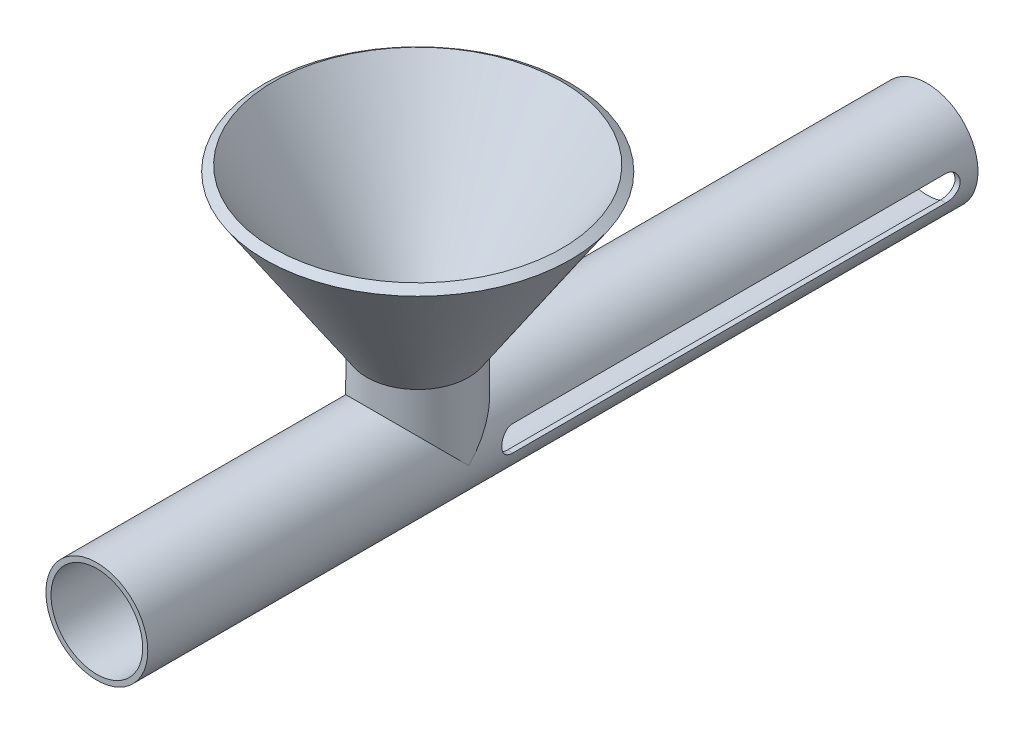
ISO-10303-21;
HEADER;
FILE_DESCRIPTION(('STEP AP214'),'2;1');
FILE_NAME('part.step','',(''),(''),'','','');
FILE_SCHEMA(('AUTOMOTIVE_DESIGN { 1 0 10303 214 1 1 1 1 }'));
ENDSEC;
DATA;
#1=APPLICATION_CONTEXT('core data for automotive mechanical design processes');
#2=APPLICATION_PROTOCOL_DEFINITION('international standard','automotive_design',2000,#1);
#3=PRODUCT_CONTEXT('',#1,'mechanical');
#4=PRODUCT('Part','Part','',(#3));
#5=PRODUCT_RELATED_PRODUCT_CATEGORY('part','',(#4));
#6=PRODUCT_DEFINITION_FORMATION('','',#4);
#7=PRODUCT_DEFINITION_CONTEXT('part definition',#1,'design');
#8=PRODUCT_DEFINITION('design','',#6,#7);
#9=PRODUCT_DEFINITION_SHAPE('','',#8);
#10=(LENGTH_UNIT() NAMED_UNIT(*) SI_UNIT(.MILLI.,.METRE.));
#11=(NAMED_UNIT(*) PLANE_ANGLE_UNIT() SI_UNIT($,.RADIAN.));
#12=(NAMED_UNIT(*) SI_UNIT($,.STERADIAN.) SOLID_ANGLE_UNIT());
#13=UNCERTAINTY_MEASURE_WITH_UNIT(LENGTH_MEASURE(1.E-05),#10,'distance_accuracy_value','');
#14=(GEOMETRIC_REPRESENTATION_CONTEXT(3) GLOBAL_UNCERTAINTY_ASSIGNED_CONTEXT((#13)) GLOBAL_UNIT_ASSIGNED_CONTEXT((#10,
#11,#12)) REPRESENTATION_CONTEXT('',''));
#15=CARTESIAN_POINT('',(0.,0.,0.));
#16=DIRECTION('',(0.,0.,1.));
#17=DIRECTION('',(1.,0.,0.));
#18=AXIS2_PLACEMENT_3D('',#15,#16,#17);
#19=CARTESIAN_POINT('',(0.,16.1094003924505,-63.));
#20=DIRECTION('',(0.,1.,0.));
#21=DIRECTION('',(0.,0.,1.));
#22=AXIS2_PLACEMENT_3D('',#19,#20,#21);
#23=CONICAL_SURFACE('',#22,8.33589941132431,0.588002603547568);
#24=CARTESIAN_POINT('',(0.,46.1094003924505,-63.));
#25=DIRECTION('',(0.,1.,0.));
#26=DIRECTION('',(0.,0.,-1.));
#27=AXIS2_PLACEMENT_3D('',#24,#25,#26);
#28=CIRCLE('',#27,28.3358994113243);
#29=CARTESIAN_POINT('',(0.,46.1094003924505,-91.3358994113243));
#30=VERTEX_POINT('',#29);
#31=EDGE_CURVE('E330',#30,#30,#28,.T.);
#32=ORIENTED_EDGE('',*,*,#31,.T.);
#33=EDGE_LOOP('',(#32));
#34=FACE_BOUND('',#33,.T.);
#35=CARTESIAN_POINT('',(0.,17.105551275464,-63.));
#36=DIRECTION('',(0.,1.,0.));
#37=DIRECTION('',(0.,0.,1.));
#38=AXIS2_PLACEMENT_3D('',#35,#36,#37);
#39=CIRCLE('',#38,8.99999999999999);
#40=CARTESIAN_POINT('',(0.,17.105551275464,-54.));
#41=VERTEX_POINT('',#40);
#42=EDGE_CURVE('E338',#41,#41,#39,.T.);
#43=ORIENTED_EDGE('',*,*,#42,.F.);
#44=EDGE_LOOP('',(#43));
#45=FACE_BOUND('',#44,.T.);
#46=ADVANCED_FACE('F44',(#34,#45),#23,.F.);
#47=CARTESIAN_POINT('',(0.,0.,-163.));
#48=DIRECTION('',(0.,0.,1.));
#49=DIRECTION('',(1.,0.,0.));
#50=AXIS2_PLACEMENT_3D('',#47,#48,#49);
#51=CYLINDRICAL_SURFACE('',#50,10.);
#52=CARTESIAN_POINT('',(9.68245836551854,2.5,-71.9954789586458));
#53=CARTESIAN_POINT('',(9.68245064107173,2.5000080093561,-71.9263411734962));
#54=CARTESIAN_POINT('',(9.68319871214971,2.49713210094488,-71.8572081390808));
#55=CARTESIAN_POINT('',(9.68614915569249,2.4856746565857,-71.7194590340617));
#56=CARTESIAN_POINT('',(9.68835128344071,2.477094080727,-71.6508428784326));
#57=CARTESIAN_POINT('',(9.69414685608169,2.4543119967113,-71.5147459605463));
#58=CARTESIAN_POINT('',(9.69773754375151,2.4401216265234,-71.4472632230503));
#59=CARTESIAN_POINT('',(9.70619672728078,2.40625174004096,-71.3137901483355));
#60=CARTESIAN_POINT('',(9.71106524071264,2.3865721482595,-71.2477998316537));
#61=CARTESIAN_POINT('',(9.7273836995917,2.31951549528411,-71.0527688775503));
#62=CARTESIAN_POINT('',(9.74055281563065,2.26409745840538,-70.9265315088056));
#63=CARTESIAN_POINT('',(9.76997886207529,2.13353299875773,-70.6851730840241));
#64=CARTESIAN_POINT('',(9.78623662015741,2.05838128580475,-70.5700550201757));
#65=CARTESIAN_POINT('',(9.82040642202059,1.88871268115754,-70.3516267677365));
#66=CARTESIAN_POINT('',(9.83834473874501,1.79384357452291,-70.2485937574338));
#67=CARTESIAN_POINT('',(9.87362764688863,1.5881890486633,-70.0597217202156));
#68=CARTESIAN_POINT('',(9.89097214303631,1.47740109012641,-69.9738854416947));
#69=CARTESIAN_POINT('',(9.92340454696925,1.24114235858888,-69.8207020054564));
#70=CARTESIAN_POINT('',(9.93845761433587,1.11548838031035,-69.7536293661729));
#71=CARTESIAN_POINT('',(9.96430865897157,0.854256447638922,-69.6416669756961));
#72=CARTESIAN_POINT('',(9.97510747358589,0.718680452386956,-69.5967728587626));
#73=CARTESIAN_POINT('',(9.99104749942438,0.444360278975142,-69.5313315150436));
#74=CARTESIAN_POINT('',(9.99629882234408,0.305735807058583,-69.5103097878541));
#75=CARTESIAN_POINT('',(10.0009359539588,0.026831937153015,-69.4917205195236));
#76=CARTESIAN_POINT('',(10.0003224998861,-0.113447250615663,-69.4941500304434));
#77=CARTESIAN_POINT('',(9.99338093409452,-0.388381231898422,-69.5220538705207));
#78=CARTESIAN_POINT('',(9.98717996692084,-0.523091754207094,-69.5470155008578));
#79=CARTESIAN_POINT('',(9.96990826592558,-0.786346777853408,-69.6184506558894));
#80=CARTESIAN_POINT('',(9.95883731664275,-0.914891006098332,-69.6649251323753));
#81=CARTESIAN_POINT('',(9.93287494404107,-1.16351821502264,-69.7784821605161));
#82=CARTESIAN_POINT('',(9.91794984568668,-1.28351407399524,-69.8457474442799));
#83=CARTESIAN_POINT('',(9.88589863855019,-1.51069157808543,-69.9988367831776));
#84=CARTESIAN_POINT('',(9.86877219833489,-1.61787128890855,-70.0846636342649));
#85=CARTESIAN_POINT('',(9.83363915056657,-1.81942347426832,-70.2751762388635));
#86=CARTESIAN_POINT('',(9.81562126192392,-1.9133727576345,-70.3803080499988));
#87=CARTESIAN_POINT('',(9.78115420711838,-2.08242393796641,-70.6050536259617));
#88=CARTESIAN_POINT('',(9.76470547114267,-2.15752067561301,-70.7246713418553));
#89=CARTESIAN_POINT('',(9.73519533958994,-2.28701177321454,-70.9758429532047));
#90=CARTESIAN_POINT('',(9.72215264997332,-2.34129254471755,-71.1074576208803));
#91=CARTESIAN_POINT('',(9.70117647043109,-2.42675587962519,-71.3782712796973));
#92=CARTESIAN_POINT('',(9.693235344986,-2.45797297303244,-71.5174585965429));
#93=CARTESIAN_POINT('',(9.6863822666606,-2.48476158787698,-71.7141224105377));
#94=CARTESIAN_POINT('',(9.68491307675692,-2.49047697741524,-71.7702782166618));
#95=CARTESIAN_POINT('',(9.6829515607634,-2.49809189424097,-71.8827734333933));
#96=CARTESIAN_POINT('',(9.68245765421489,-2.49999759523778,-71.9391123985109));
#97=CARTESIAN_POINT('',(9.68245836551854,-2.5,-71.9954789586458));
#98=B_SPLINE_CURVE_WITH_KNOTS('',3,(#52,#53,#54,#55,#56,#57,#58,#59,#60,#61,#62,#63,#64,#65,#66,
#67,#68,#69,#70,#71,#72,#73,#74,#75,#76,#77,#78,#79,#80,#81,#82,#83,#84,#85,#86,#87,#88,#89,#90,
#91,#92,#93,#94,#95,#96,#97),.UNSPECIFIED.,.F.,.F.,(4,2,2,2,2,2,2,2,2,2,2,2,2,2,2,2,2,2,2,2,2,2,
4),(0.,0.20734132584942,0.414647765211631,0.621544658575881,0.828444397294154,1.2418326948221,
1.65533192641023,2.07697423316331,2.49868387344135,2.92627416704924,3.35378025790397,
3.77263152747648,4.19143014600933,4.60093312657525,5.01045422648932,5.42368222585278,
5.83697251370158,6.26140522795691,6.68595396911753,7.11278749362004,7.53898067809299,
7.70826570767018,7.87727618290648),.UNSPECIFIED.);
#99=CARTESIAN_POINT('',(9.68245836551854,2.5,-71.9954789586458));
#100=VERTEX_POINT('',#99);
#101=CARTESIAN_POINT('',(9.68245836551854,-2.5,-71.9954789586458));
#102=VERTEX_POINT('',#101);
#103=EDGE_CURVE('E240',#100,#102,#98,.T.);
#104=ORIENTED_EDGE('',*,*,#103,.F.);
#105=DIRECTION('',(0.,0.,1.));
#106=VECTOR('',#105,1.);
#107=CARTESIAN_POINT('',(9.68245836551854,2.5,-163.));
#108=LINE('',#107,#106);
#109=CARTESIAN_POINT('',(9.68245836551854,2.5,-156.995478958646));
#110=VERTEX_POINT('',#109);
#111=EDGE_CURVE('E248',#110,#100,#108,.T.);
#112=ORIENTED_EDGE('',*,*,#111,.F.);
#113=CARTESIAN_POINT('',(9.68245836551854,-2.5,-156.995478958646));
#114=CARTESIAN_POINT('',(9.68245064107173,-2.5000080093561,-157.064616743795));
#115=CARTESIAN_POINT('',(9.68319871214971,-2.49713210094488,-157.133749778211));
#116=CARTESIAN_POINT('',(9.68614915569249,-2.4856746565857,-157.27149888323));
#117=CARTESIAN_POINT('',(9.68835128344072,-2.477094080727,-157.340115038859));
#118=CARTESIAN_POINT('',(9.6941468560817,-2.4543119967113,-157.476211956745));
#119=CARTESIAN_POINT('',(9.69773754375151,-2.44012162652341,-157.543694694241));
#120=CARTESIAN_POINT('',(9.70619672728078,-2.40625174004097,-157.677167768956));
#121=CARTESIAN_POINT('',(9.71106524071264,-2.3865721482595,-157.743158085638));
#122=CARTESIAN_POINT('',(9.7273836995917,-2.31951549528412,-157.938189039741));
#123=CARTESIAN_POINT('',(9.74055281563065,-2.26409745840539,-158.064426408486));
#124=CARTESIAN_POINT('',(9.76997886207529,-2.13353299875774,-158.305784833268));
#125=CARTESIAN_POINT('',(9.7862366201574,-2.05838128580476,-158.420902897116));
#126=CARTESIAN_POINT('',(9.82040642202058,-1.88871268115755,-158.639331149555));
#127=CARTESIAN_POINT('',(9.83834473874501,-1.79384357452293,-158.742364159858));
#128=CARTESIAN_POINT('',(9.87362764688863,-1.58818904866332,-158.931236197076));
#129=CARTESIAN_POINT('',(9.89097214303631,-1.47740109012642,-159.017072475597));
#130=CARTESIAN_POINT('',(9.92340454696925,-1.24114235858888,-159.170255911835));
#131=CARTESIAN_POINT('',(9.93845761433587,-1.11548838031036,-159.237328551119));
#132=CARTESIAN_POINT('',(9.96430865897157,-0.854256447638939,-159.349290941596));
#133=CARTESIAN_POINT('',(9.97510747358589,-0.71868045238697,-159.394185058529));
#134=CARTESIAN_POINT('',(9.99104749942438,-0.444360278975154,-159.459626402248));
#135=CARTESIAN_POINT('',(9.99629882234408,-0.305735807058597,-159.480648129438));
#136=CARTESIAN_POINT('',(10.0009359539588,-0.0268319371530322,-159.499237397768));
#137=CARTESIAN_POINT('',(10.0003224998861,0.113447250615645,-159.496807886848));
#138=CARTESIAN_POINT('',(9.99338093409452,0.388381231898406,-159.468904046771));
#139=CARTESIAN_POINT('',(9.98717996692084,0.523091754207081,-159.443942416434));
#140=CARTESIAN_POINT('',(9.96990826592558,0.786346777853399,-159.372507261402));
#141=CARTESIAN_POINT('',(9.95883731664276,0.914891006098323,-159.326032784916));
#142=CARTESIAN_POINT('',(9.93287494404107,1.16351821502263,-159.212475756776));
#143=CARTESIAN_POINT('',(9.91794984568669,1.28351407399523,-159.145210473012));
#144=CARTESIAN_POINT('',(9.88589863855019,1.51069157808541,-158.992121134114));
#145=CARTESIAN_POINT('',(9.8687721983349,1.61787128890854,-158.906294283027));
#146=CARTESIAN_POINT('',(9.83363915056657,1.81942347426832,-158.715781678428));
#147=CARTESIAN_POINT('',(9.81562126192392,1.9133727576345,-158.610649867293));
#148=CARTESIAN_POINT('',(9.78115420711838,2.08242393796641,-158.38590429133));
#149=CARTESIAN_POINT('',(9.76470547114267,2.15752067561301,-158.266286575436));
#150=CARTESIAN_POINT('',(9.73519533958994,2.28701177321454,-158.015114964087));
#151=CARTESIAN_POINT('',(9.72215264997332,2.34129254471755,-157.883500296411));
#152=CARTESIAN_POINT('',(9.70117647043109,2.42675587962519,-157.612686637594));
#153=CARTESIAN_POINT('',(9.693235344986,2.45797297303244,-157.473499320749));
#154=CARTESIAN_POINT('',(9.6863822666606,2.48476158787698,-157.276835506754));
#155=CARTESIAN_POINT('',(9.68491307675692,2.49047697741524,-157.22067970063));
#156=CARTESIAN_POINT('',(9.6829515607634,2.49809189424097,-157.108184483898));
#157=CARTESIAN_POINT('',(9.68245765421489,2.49999759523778,-157.051845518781));
#158=CARTESIAN_POINT('',(9.68245836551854,2.5,-156.995478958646));
#159=B_SPLINE_CURVE_WITH_KNOTS('',3,(#113,#114,#115,#116,#117,#118,#119,#120,#121,#122,#123,
#124,#125,#126,#127,#128,#129,#130,#131,#132,#133,#134,#135,#136,#137,#138,#139,#140,#141,#142,
#143,#144,#145,#146,#147,#148,#149,#150,#151,#152,#153,#154,#155,#156,#157,#158),.UNSPECIFIED.,
.F.,.F.,(4,2,2,2,2,2,2,2,2,2,2,2,2,2,2,2,2,2,2,2,2,2,4),(0.,0.207341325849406,0.414647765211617,
0.621544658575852,0.828444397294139,1.24183269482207,1.65533192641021,2.07697423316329,
2.49868387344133,2.92627416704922,3.35378025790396,3.77263152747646,4.19143014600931,
4.60093312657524,5.0104542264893,5.42368222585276,5.83697251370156,6.26140522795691,
6.68595396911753,7.11278749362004,7.53898067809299,7.70826570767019,7.87727618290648),.UNSPECIFIED.);
#160=CARTESIAN_POINT('',(9.68245836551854,-2.5,-156.995478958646));
#161=VERTEX_POINT('',#160);
#162=EDGE_CURVE('E152',#161,#110,#159,.T.);
#163=ORIENTED_EDGE('',*,*,#162,.F.);
#164=DIRECTION('',(0.,0.,1.));
#165=VECTOR('',#164,1.);
#166=CARTESIAN_POINT('',(9.68245836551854,-2.5,-163.));
#167=LINE('',#166,#165);
#168=EDGE_CURVE('E150',#102,#161,#167,.F.);
#169=ORIENTED_EDGE('',*,*,#168,.F.);
#170=EDGE_LOOP('',(#104,#112,#163,#169));
#171=FACE_BOUND('',#170,.T.);
#172=CARTESIAN_POINT('',(-9.68245836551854,-2.5,-71.9954789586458));
#173=CARTESIAN_POINT('',(-9.68245064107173,-2.5000080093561,-71.9263411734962));
#174=CARTESIAN_POINT('',(-9.68319871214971,-2.49713210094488,-71.8572081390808));
#175=CARTESIAN_POINT('',(-9.68614915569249,-2.4856746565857,-71.7194590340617));
#176=CARTESIAN_POINT('',(-9.68835128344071,-2.477094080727,-71.6508428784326));
#177=CARTESIAN_POINT('',(-9.69414685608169,-2.4543119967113,-71.5147459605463));
#178=CARTESIAN_POINT('',(-9.69773754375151,-2.4401216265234,-71.4472632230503));
#179=CARTESIAN_POINT('',(-9.70619672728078,-2.40625174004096,-71.3137901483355));
#180=CARTESIAN_POINT('',(-9.71106524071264,-2.3865721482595,-71.2477998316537));
#181=CARTESIAN_POINT('',(-9.7273836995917,-2.31951549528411,-71.0527688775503));
#182=CARTESIAN_POINT('',(-9.74055281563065,-2.26409745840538,-70.9265315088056));
#183=CARTESIAN_POINT('',(-9.76997886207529,-2.13353299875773,-70.6851730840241));
#184=CARTESIAN_POINT('',(-9.78623662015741,-2.05838128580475,-70.5700550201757));
#185=CARTESIAN_POINT('',(-9.82040642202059,-1.88871268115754,-70.3516267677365));
#186=CARTESIAN_POINT('',(-9.83834473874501,-1.79384357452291,-70.2485937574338));
#187=CARTESIAN_POINT('',(-9.87362764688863,-1.5881890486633,-70.0597217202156));
#188=CARTESIAN_POINT('',(-9.89097214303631,-1.47740109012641,-69.9738854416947));
#189=CARTESIAN_POINT('',(-9.92340454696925,-1.24114235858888,-69.8207020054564));
#190=CARTESIAN_POINT('',(-9.93845761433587,-1.11548838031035,-69.7536293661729));
#191=CARTESIAN_POINT('',(-9.96430865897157,-0.854256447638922,-69.6416669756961));
#192=CARTESIAN_POINT('',(-9.97510747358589,-0.718680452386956,-69.5967728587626));
#193=CARTESIAN_POINT('',(-9.99104749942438,-0.444360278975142,-69.5313315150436));
#194=CARTESIAN_POINT('',(-9.99629882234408,-0.305735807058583,-69.5103097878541));
#195=CARTESIAN_POINT('',(-10.0009359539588,-0.026831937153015,-69.4917205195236));
#196=CARTESIAN_POINT('',(-10.0003224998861,0.113447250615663,-69.4941500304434));
#197=CARTESIAN_POINT('',(-9.99338093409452,0.388381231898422,-69.5220538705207));
#198=CARTESIAN_POINT('',(-9.98717996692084,0.523091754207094,-69.5470155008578));
#199=CARTESIAN_POINT('',(-9.96990826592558,0.786346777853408,-69.6184506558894));
#200=CARTESIAN_POINT('',(-9.95883731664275,0.914891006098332,-69.6649251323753));
#201=CARTESIAN_POINT('',(-9.93287494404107,1.16351821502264,-69.7784821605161));
#202=CARTESIAN_POINT('',(-9.91794984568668,1.28351407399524,-69.8457474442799));
#203=CARTESIAN_POINT('',(-9.88589863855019,1.51069157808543,-69.9988367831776));
#204=CARTESIAN_POINT('',(-9.86877219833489,1.61787128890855,-70.0846636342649));
#205=CARTESIAN_POINT('',(-9.83363915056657,1.81942347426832,-70.2751762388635));
#206=CARTESIAN_POINT('',(-9.81562126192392,1.9133727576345,-70.3803080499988));
#207=CARTESIAN_POINT('',(-9.78115420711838,2.08242393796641,-70.6050536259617));
#208=CARTESIAN_POINT('',(-9.76470547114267,2.15752067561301,-70.7246713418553));
#209=CARTESIAN_POINT('',(-9.73519533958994,2.28701177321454,-70.9758429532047));
#210=CARTESIAN_POINT('',(-9.72215264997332,2.34129254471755,-71.1074576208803));
#211=CARTESIAN_POINT('',(-9.70117647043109,2.42675587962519,-71.3782712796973));
#212=CARTESIAN_POINT('',(-9.693235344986,2.45797297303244,-71.5174585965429));
#213=CARTESIAN_POINT('',(-9.6863822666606,2.48476158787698,-71.7141224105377));
#214=CARTESIAN_POINT('',(-9.68491307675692,2.49047697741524,-71.7702782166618));
#215=CARTESIAN_POINT('',(-9.6829515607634,2.49809189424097,-71.8827734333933));
#216=CARTESIAN_POINT('',(-9.68245765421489,2.49999759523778,-71.9391123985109));
#217=CARTESIAN_POINT('',(-9.68245836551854,2.5,-71.9954789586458));
#218=B_SPLINE_CURVE_WITH_KNOTS('',3,(#172,#173,#174,#175,#176,#177,#178,#179,#180,#181,#182,
#183,#184,#185,#186,#187,#188,#189,#190,#191,#192,#193,#194,#195,#196,#197,#198,#199,#200,#201,
#202,#203,#204,#205,#206,#207,#208,#209,#210,#211,#212,#213,#214,#215,#216,#217),.UNSPECIFIED.,
.F.,.F.,(4,2,2,2,2,2,2,2,2,2,2,2,2,2,2,2,2,2,2,2,2,2,4),(0.,0.20734132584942,0.414647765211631,
0.621544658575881,0.828444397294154,1.2418326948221,1.65533192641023,2.07697423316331,
2.49868387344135,2.92627416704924,3.35378025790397,3.77263152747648,4.19143014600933,
4.60093312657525,5.01045422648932,5.42368222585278,5.83697251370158,6.26140522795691,
6.68595396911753,7.11278749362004,7.53898067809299,7.70826570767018,7.87727618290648),.UNSPECIFIED.);
#219=CARTESIAN_POINT('',(-9.68245836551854,-2.5,-71.9954789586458));
#220=VERTEX_POINT('',#219);
#221=CARTESIAN_POINT('',(-9.68245836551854,2.5,-71.9954789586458));
#222=VERTEX_POINT('',#221);
#223=EDGE_CURVE('E232',#220,#222,#218,.T.);
#224=ORIENTED_EDGE('',*,*,#223,.F.);
#225=DIRECTION('',(0.,0.,1.));
#226=VECTOR('',#225,1.);
#227=CARTESIAN_POINT('',(-9.68245836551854,-2.5,-163.));
#228=LINE('',#227,#226);
#229=CARTESIAN_POINT('',(-9.68245836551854,-2.5,-156.995478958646));
#230=VERTEX_POINT('',#229);
#231=EDGE_CURVE('E148',#230,#220,#228,.T.);
#232=ORIENTED_EDGE('',*,*,#231,.F.);
#233=CARTESIAN_POINT('',(-9.68245836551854,2.5,-156.995478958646));
#234=CARTESIAN_POINT('',(-9.68245064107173,2.5000080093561,-157.064616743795));
#235=CARTESIAN_POINT('',(-9.68319871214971,2.49713210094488,-157.133749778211));
#236=CARTESIAN_POINT('',(-9.68614915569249,2.4856746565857,-157.27149888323));
#237=CARTESIAN_POINT('',(-9.68835128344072,2.477094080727,-157.340115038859));
#238=CARTESIAN_POINT('',(-9.6941468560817,2.4543119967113,-157.476211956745));
#239=CARTESIAN_POINT('',(-9.69773754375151,2.44012162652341,-157.543694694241));
#240=CARTESIAN_POINT('',(-9.70619672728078,2.40625174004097,-157.677167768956));
#241=CARTESIAN_POINT('',(-9.71106524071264,2.3865721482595,-157.743158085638));
#242=CARTESIAN_POINT('',(-9.7273836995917,2.31951549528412,-157.938189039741));
#243=CARTESIAN_POINT('',(-9.74055281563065,2.26409745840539,-158.064426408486));
#244=CARTESIAN_POINT('',(-9.76997886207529,2.13353299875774,-158.305784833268));
#245=CARTESIAN_POINT('',(-9.7862366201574,2.05838128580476,-158.420902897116));
#246=CARTESIAN_POINT('',(-9.82040642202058,1.88871268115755,-158.639331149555));
#247=CARTESIAN_POINT('',(-9.83834473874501,1.79384357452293,-158.742364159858));
#248=CARTESIAN_POINT('',(-9.87362764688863,1.58818904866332,-158.931236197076));
#249=CARTESIAN_POINT('',(-9.89097214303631,1.47740109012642,-159.017072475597));
#250=CARTESIAN_POINT('',(-9.92340454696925,1.24114235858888,-159.170255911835));
#251=CARTESIAN_POINT('',(-9.93845761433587,1.11548838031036,-159.237328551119));
#252=CARTESIAN_POINT('',(-9.96430865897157,0.854256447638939,-159.349290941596));
#253=CARTESIAN_POINT('',(-9.97510747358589,0.71868045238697,-159.394185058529));
#254=CARTESIAN_POINT('',(-9.99104749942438,0.444360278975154,-159.459626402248));
#255=CARTESIAN_POINT('',(-9.99629882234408,0.305735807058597,-159.480648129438));
#256=CARTESIAN_POINT('',(-10.0009359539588,0.0268319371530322,-159.499237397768));
#257=CARTESIAN_POINT('',(-10.0003224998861,-0.113447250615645,-159.496807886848));
#258=CARTESIAN_POINT('',(-9.99338093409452,-0.388381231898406,-159.468904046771));
#259=CARTESIAN_POINT('',(-9.98717996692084,-0.523091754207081,-159.443942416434));
#260=CARTESIAN_POINT('',(-9.96990826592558,-0.786346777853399,-159.372507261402));
#261=CARTESIAN_POINT('',(-9.95883731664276,-0.914891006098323,-159.326032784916));
#262=CARTESIAN_POINT('',(-9.93287494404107,-1.16351821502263,-159.212475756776));
#263=CARTESIAN_POINT('',(-9.91794984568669,-1.28351407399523,-159.145210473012));
#264=CARTESIAN_POINT('',(-9.88589863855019,-1.51069157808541,-158.992121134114));
#265=CARTESIAN_POINT('',(-9.8687721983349,-1.61787128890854,-158.906294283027));
#266=CARTESIAN_POINT('',(-9.83363915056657,-1.81942347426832,-158.715781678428));
#267=CARTESIAN_POINT('',(-9.81562126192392,-1.9133727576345,-158.610649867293));
#268=CARTESIAN_POINT('',(-9.78115420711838,-2.08242393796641,-158.38590429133));
#269=CARTESIAN_POINT('',(-9.76470547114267,-2.15752067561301,-158.266286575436));
#270=CARTESIAN_POINT('',(-9.73519533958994,-2.28701177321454,-158.015114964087));
#271=CARTESIAN_POINT('',(-9.72215264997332,-2.34129254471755,-157.883500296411));
#272=CARTESIAN_POINT('',(-9.70117647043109,-2.42675587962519,-157.612686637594));
#273=CARTESIAN_POINT('',(-9.693235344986,-2.45797297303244,-157.473499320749));
#274=CARTESIAN_POINT('',(-9.6863822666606,-2.48476158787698,-157.276835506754));
#275=CARTESIAN_POINT('',(-9.68491307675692,-2.49047697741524,-157.22067970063));
#276=CARTESIAN_POINT('',(-9.6829515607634,-2.49809189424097,-157.108184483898));
#277=CARTESIAN_POINT('',(-9.68245765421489,-2.49999759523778,-157.051845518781));
#278=CARTESIAN_POINT('',(-9.68245836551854,-2.5,-156.995478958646));
#279=B_SPLINE_CURVE_WITH_KNOTS('',3,(#233,#234,#235,#236,#237,#238,#239,#240,#241,#242,#243,
#244,#245,#246,#247,#248,#249,#250,#251,#252,#253,#254,#255,#256,#257,#258,#259,#260,#261,#262,
#263,#264,#265,#266,#267,#268,#269,#270,#271,#272,#273,#274,#275,#276,#277,#278),.UNSPECIFIED.,
.F.,.F.,(4,2,2,2,2,2,2,2,2,2,2,2,2,2,2,2,2,2,2,2,2,2,4),(0.,0.207341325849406,0.414647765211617,
0.621544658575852,0.828444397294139,1.24183269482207,1.65533192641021,2.07697423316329,
2.49868387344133,2.92627416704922,3.35378025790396,3.77263152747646,4.19143014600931,
4.60093312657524,5.0104542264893,5.42368222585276,5.83697251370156,6.26140522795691,
6.68595396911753,7.11278749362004,7.53898067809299,7.70826570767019,7.87727618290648),.UNSPECIFIED.);
#280=CARTESIAN_POINT('',(-9.68245836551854,2.5,-156.995478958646));
#281=VERTEX_POINT('',#280);
#282=EDGE_CURVE('E159',#281,#230,#279,.T.);
#283=ORIENTED_EDGE('',*,*,#282,.F.);
#284=DIRECTION('',(0.,0.,1.));
#285=VECTOR('',#284,1.);
#286=CARTESIAN_POINT('',(-9.68245836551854,2.5,-163.));
#287=LINE('',#286,#285);
#288=EDGE_CURVE('E247',#222,#281,#287,.F.);
#289=ORIENTED_EDGE('',*,*,#288,.F.);
#290=EDGE_LOOP('',(#224,#232,#283,#289));
#291=FACE_BOUND('',#290,.T.);
#292=CARTESIAN_POINT('',(0.,0.,-163.));
#293=DIRECTION('',(0.,0.,1.));
#294=DIRECTION('',(1.,0.,0.));
#295=AXIS2_PLACEMENT_3D('',#292,#293,#294);
#296=CIRCLE('',#295,10.);
#297=CARTESIAN_POINT('',(10.,0.,-163.));
#298=VERTEX_POINT('',#297);
#299=EDGE_CURVE('E220',#298,#298,#296,.T.);
#300=ORIENTED_EDGE('',*,*,#299,.T.);
#301=EDGE_LOOP('',(#300));
#302=FACE_BOUND('',#301,.T.);
#303=CARTESIAN_POINT('',(0.,0.,0.));
#304=DIRECTION('',(0.,0.,1.));
#305=DIRECTION('',(1.,0.,0.));
#306=AXIS2_PLACEMENT_3D('',#303,#304,#305);
#307=CIRCLE('',#306,10.);
#308=CARTESIAN_POINT('',(10.,0.,0.));
#309=VERTEX_POINT('',#308);
#310=EDGE_CURVE('E223',#309,#309,#307,.T.);
#311=ORIENTED_EDGE('',*,*,#310,.F.);
#312=EDGE_LOOP('',(#311));
#313=FACE_BOUND('',#312,.T.);
#314=CARTESIAN_POINT('',(0.,0.,-63.));
#315=DIRECTION('',(0.,0.707106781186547,0.707106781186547));
#316=DIRECTION('',(0.,-0.707106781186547,0.707106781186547));
#317=AXIS2_PLACEMENT_3D('',#314,#315,#316);
#318=ELLIPSE('',#317,14.1421356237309,10.);
#319=CARTESIAN_POINT('',(-10.,0.,-63.));
#320=VERTEX_POINT('',#319);
#321=CARTESIAN_POINT('',(10.,0.,-63.));
#322=VERTEX_POINT('',#321);
#323=EDGE_CURVE('E122',#320,#322,#318,.F.);
#324=ORIENTED_EDGE('',*,*,#323,.T.);
#325=CARTESIAN_POINT('',(0.,0.,-63.));
#326=DIRECTION('',(0.,-0.707106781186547,0.707106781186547));
#327=DIRECTION('',(0.,0.707106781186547,0.707106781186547));
#328=AXIS2_PLACEMENT_3D('',#325,#326,#327);
#329=ELLIPSE('',#328,14.1421356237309,10.);
#330=EDGE_CURVE('E126',#322,#320,#329,.T.);
#331=ORIENTED_EDGE('',*,*,#330,.T.);
#332=EDGE_LOOP('',(#324,#331));
#333=FACE_BOUND('',#332,.T.);
#334=ADVANCED_FACE('F46',(#171,#291,#302,#313,#333),#51,.T.);
#335=CARTESIAN_POINT('',(0.,0.,-163.));
#336=DIRECTION('',(0.,0.,1.));
#337=DIRECTION('',(1.,0.,0.));
#338=AXIS2_PLACEMENT_3D('',#335,#336,#337);
#339=CYLINDRICAL_SURFACE('',#338,9.);
#340=DIRECTION('',(0.,0.,1.));
#341=VECTOR('',#340,1.);
#342=CARTESIAN_POINT('',(-8.64580823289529,-2.5,-163.));
#343=LINE('',#342,#341);
#344=CARTESIAN_POINT('',(-8.64580823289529,-2.5,-156.995478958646));
#345=VERTEX_POINT('',#344);
#346=CARTESIAN_POINT('',(-8.64580823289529,-2.5,-71.9954789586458));
#347=VERTEX_POINT('',#346);
#348=EDGE_CURVE('E219',#345,#347,#343,.T.);
#349=ORIENTED_EDGE('',*,*,#348,.T.);
#350=CARTESIAN_POINT('',(-8.64580823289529,-2.5,-71.9954789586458));
#351=CARTESIAN_POINT('',(-8.64579950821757,-2.50000830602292,-71.9266204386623));
#352=CARTESIAN_POINT('',(-8.64663065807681,-2.49715524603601,-71.8577670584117));
#353=CARTESIAN_POINT('',(-8.64990792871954,-2.48579096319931,-71.7205807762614));
#354=CARTESIAN_POINT('',(-8.65235372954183,-2.47728086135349,-71.6522477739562));
#355=CARTESIAN_POINT('',(-8.6587882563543,-2.45469269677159,-71.516738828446));
#356=CARTESIAN_POINT('',(-8.66277346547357,-2.44062732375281,-71.449560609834));
#357=CARTESIAN_POINT('',(-8.67215936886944,-2.40706322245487,-71.3166947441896));
#358=CARTESIAN_POINT('',(-8.6775600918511,-2.38756438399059,-71.2510071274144));
#359=CARTESIAN_POINT('',(-8.69565518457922,-2.3211450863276,-71.0568935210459));
#360=CARTESIAN_POINT('',(-8.71025040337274,-2.26627569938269,-70.9312614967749));
#361=CARTESIAN_POINT('',(-8.74285051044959,-2.13704900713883,-70.6909981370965));
#362=CARTESIAN_POINT('',(-8.76085667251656,-2.0626844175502,-70.5763709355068));
#363=CARTESIAN_POINT('',(-8.79879412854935,-1.89441897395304,-70.3582258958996));
#364=CARTESIAN_POINT('',(-8.81876164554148,-1.80008616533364,-70.2550468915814));
#365=CARTESIAN_POINT('',(-8.85806142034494,-1.59548835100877,-70.0657511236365));
#366=CARTESIAN_POINT('',(-8.87739357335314,-1.48522073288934,-69.9796371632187));
#367=CARTESIAN_POINT('',(-8.91365243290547,-1.24949780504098,-69.8254731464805));
#368=CARTESIAN_POINT('',(-8.93053115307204,-1.12381058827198,-69.7577653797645));
#369=CARTESIAN_POINT('',(-8.95956074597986,-0.862294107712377,-69.6445774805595));
#370=CARTESIAN_POINT('',(-8.9717127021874,-0.726467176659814,-69.5990922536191));
#371=CARTESIAN_POINT('',(-8.98966308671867,-0.452087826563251,-69.5327483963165));
#372=CARTESIAN_POINT('',(-8.99561125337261,-0.313685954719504,-69.5113083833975));
#373=CARTESIAN_POINT('',(-9.00100868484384,-0.035127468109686,-69.4918314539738));
#374=CARTESIAN_POINT('',(-9.00045898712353,0.105028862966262,-69.4937908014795));
#375=CARTESIAN_POINT('',(-8.99303084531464,0.379054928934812,-69.5206545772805));
#376=CARTESIAN_POINT('',(-8.98632591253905,0.512991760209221,-69.5449299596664));
#377=CARTESIAN_POINT('',(-8.96754747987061,0.774808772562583,-69.6147165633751));
#378=CARTESIAN_POINT('',(-8.95547371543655,0.902688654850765,-69.6602288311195));
#379=CARTESIAN_POINT('',(-8.92706237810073,1.15033469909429,-69.7716615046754));
#380=CARTESIAN_POINT('',(-8.91068121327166,1.27000115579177,-69.8377919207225));
#381=CARTESIAN_POINT('',(-8.87541187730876,1.49674649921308,-69.9884202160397));
#382=CARTESIAN_POINT('',(-8.85652322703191,1.60382297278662,-70.0729216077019));
#383=CARTESIAN_POINT('',(-8.81753868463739,1.80609604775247,-70.26119717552));
#384=CARTESIAN_POINT('',(-8.7974235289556,1.90078144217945,-70.3655171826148));
#385=CARTESIAN_POINT('',(-8.75880771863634,2.0714653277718,-70.5887886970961));
#386=CARTESIAN_POINT('',(-8.74030751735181,2.14745858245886,-70.7077442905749));
#387=CARTESIAN_POINT('',(-8.70692961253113,2.27904309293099,-70.9581148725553));
#388=CARTESIAN_POINT('',(-8.69208091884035,2.3344726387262,-71.0896187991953));
#389=CARTESIAN_POINT('',(-8.66804909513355,2.42219486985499,-71.3605229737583));
#390=CARTESIAN_POINT('',(-8.65885741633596,2.45452247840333,-71.4999109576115));
#391=CARTESIAN_POINT('',(-8.65066448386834,2.48315519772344,-71.699712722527));
#392=CARTESIAN_POINT('',(-8.64884681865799,2.4894721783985,-71.7587207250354));
#393=CARTESIAN_POINT('',(-8.64641887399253,2.49789031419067,-71.8769691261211));
#394=CARTESIAN_POINT('',(-8.6458067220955,2.49999800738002,-71.9362090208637));
#395=CARTESIAN_POINT('',(-8.64580823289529,2.5,-71.9954789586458));
#396=B_SPLINE_CURVE_WITH_KNOTS('',3,(#350,#351,#352,#353,#354,#355,#356,#357,#358,#359,#360,
#361,#362,#363,#364,#365,#366,#367,#368,#369,#370,#371,#372,#373,#374,#375,#376,#377,#378,#379,
#380,#381,#382,#383,#384,#385,#386,#387,#388,#389,#390,#391,#392,#393,#394,#395),.UNSPECIFIED.,
.F.,.F.,(4,2,2,2,2,2,2,2,2,2,2,2,2,2,2,2,2,2,2,2,2,2,4),(0.,0.206502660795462,0.412964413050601,
0.618957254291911,0.824954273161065,1.23648126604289,1.64816224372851,2.0698764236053,
2.49165981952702,2.92082040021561,3.34988255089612,3.76833045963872,4.18671155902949,
4.59364934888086,5.00060719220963,5.41185362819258,5.82317876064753,6.24813326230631,
6.67320667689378,7.10155530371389,7.52925501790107,7.70724135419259,7.88495101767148),.UNSPECIFIED.);
#397=CARTESIAN_POINT('',(-8.64580823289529,2.5,-71.9954789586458));
#398=VERTEX_POINT('',#397);
#399=EDGE_CURVE('E210',#347,#398,#396,.T.);
#400=ORIENTED_EDGE('',*,*,#399,.T.);
#401=DIRECTION('',(0.,0.,1.));
#402=VECTOR('',#401,1.);
#403=CARTESIAN_POINT('',(-8.64580823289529,2.5,-163.));
#404=LINE('',#403,#402);
#405=CARTESIAN_POINT('',(-8.64580823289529,2.5,-156.995478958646));
#406=VERTEX_POINT('',#405);
#407=EDGE_CURVE('E216',#398,#406,#404,.F.);
#408=ORIENTED_EDGE('',*,*,#407,.T.);
#409=CARTESIAN_POINT('',(-8.64580823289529,2.5,-156.995478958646));
#410=CARTESIAN_POINT('',(-8.64579950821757,2.50000830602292,-157.064337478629));
#411=CARTESIAN_POINT('',(-8.64663065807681,2.49715524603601,-157.13319085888));
#412=CARTESIAN_POINT('',(-8.64990792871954,2.48579096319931,-157.27037714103));
#413=CARTESIAN_POINT('',(-8.65235372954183,2.4772808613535,-157.338710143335));
#414=CARTESIAN_POINT('',(-8.6587882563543,2.45469269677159,-157.474219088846));
#415=CARTESIAN_POINT('',(-8.66277346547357,2.44062732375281,-157.541397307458));
#416=CARTESIAN_POINT('',(-8.67215936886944,2.40706322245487,-157.674263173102));
#417=CARTESIAN_POINT('',(-8.6775600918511,2.38756438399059,-157.739950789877));
#418=CARTESIAN_POINT('',(-8.69565518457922,2.3211450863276,-157.934064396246));
#419=CARTESIAN_POINT('',(-8.71025040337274,2.26627569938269,-158.059696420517));
#420=CARTESIAN_POINT('',(-8.7428505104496,2.13704900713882,-158.299959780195));
#421=CARTESIAN_POINT('',(-8.76085667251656,2.06268441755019,-158.414586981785));
#422=CARTESIAN_POINT('',(-8.79879412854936,1.89441897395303,-158.632732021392));
#423=CARTESIAN_POINT('',(-8.81876164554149,1.80008616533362,-158.73591102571));
#424=CARTESIAN_POINT('',(-8.85806142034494,1.59548835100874,-158.925206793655));
#425=CARTESIAN_POINT('',(-8.87739357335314,1.48522073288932,-159.011320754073));
#426=CARTESIAN_POINT('',(-8.91365243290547,1.24949780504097,-159.165484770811));
#427=CARTESIAN_POINT('',(-8.93053115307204,1.12381058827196,-159.233192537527));
#428=CARTESIAN_POINT('',(-8.95956074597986,0.862294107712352,-159.346380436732));
#429=CARTESIAN_POINT('',(-8.9717127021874,0.726467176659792,-159.391865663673));
#430=CARTESIAN_POINT('',(-8.98966308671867,0.45208782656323,-159.458209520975));
#431=CARTESIAN_POINT('',(-8.99561125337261,0.313685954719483,-159.479649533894));
#432=CARTESIAN_POINT('',(-9.00100868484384,0.035127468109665,-159.499126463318));
#433=CARTESIAN_POINT('',(-9.00045898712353,-0.105028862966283,-159.497167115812));
#434=CARTESIAN_POINT('',(-8.99303084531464,-0.37905492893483,-159.470303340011));
#435=CARTESIAN_POINT('',(-8.98632591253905,-0.512991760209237,-159.446027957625));
#436=CARTESIAN_POINT('',(-8.96754747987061,-0.774808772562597,-159.376241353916));
#437=CARTESIAN_POINT('',(-8.95547371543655,-0.902688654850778,-159.330729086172));
#438=CARTESIAN_POINT('',(-8.92706237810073,-1.1503346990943,-159.219296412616));
#439=CARTESIAN_POINT('',(-8.91068121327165,-1.27000115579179,-159.153165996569));
#440=CARTESIAN_POINT('',(-8.87541187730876,-1.4967464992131,-159.002537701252));
#441=CARTESIAN_POINT('',(-8.85652322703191,-1.60382297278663,-158.91803630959));
#442=CARTESIAN_POINT('',(-8.81753868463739,-1.80609604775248,-158.729760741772));
#443=CARTESIAN_POINT('',(-8.7974235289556,-1.90078144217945,-158.625440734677));
#444=CARTESIAN_POINT('',(-8.75880771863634,-2.07146532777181,-158.402169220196));
#445=CARTESIAN_POINT('',(-8.74030751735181,-2.14745858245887,-158.283213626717));
#446=CARTESIAN_POINT('',(-8.70692961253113,-2.279043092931,-158.032843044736));
#447=CARTESIAN_POINT('',(-8.69208091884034,-2.33447263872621,-157.901339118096));
#448=CARTESIAN_POINT('',(-8.66804909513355,-2.42219486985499,-157.630434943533));
#449=CARTESIAN_POINT('',(-8.65885741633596,-2.45452247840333,-157.49104695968));
#450=CARTESIAN_POINT('',(-8.65066448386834,-2.48315519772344,-157.291245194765));
#451=CARTESIAN_POINT('',(-8.64884681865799,-2.4894721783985,-157.232237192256));
#452=CARTESIAN_POINT('',(-8.64641887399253,-2.49789031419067,-157.113988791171));
#453=CARTESIAN_POINT('',(-8.6458067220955,-2.49999800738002,-157.054748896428));
#454=CARTESIAN_POINT('',(-8.64580823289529,-2.5,-156.995478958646));
#455=B_SPLINE_CURVE_WITH_KNOTS('',3,(#409,#410,#411,#412,#413,#414,#415,#416,#417,#418,#419,
#420,#421,#422,#423,#424,#425,#426,#427,#428,#429,#430,#431,#432,#433,#434,#435,#436,#437,#438,
#439,#440,#441,#442,#443,#444,#445,#446,#447,#448,#449,#450,#451,#452,#453,#454),.UNSPECIFIED.,
.F.,.F.,(4,2,2,2,2,2,2,2,2,2,2,2,2,2,2,2,2,2,2,2,2,2,4),(0.,0.206502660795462,0.412964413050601,
0.618957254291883,0.82495427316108,1.23648126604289,1.64816224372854,2.06987642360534,
2.49165981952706,2.92082040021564,3.34988255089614,3.76833045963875,4.18671155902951,
4.59364934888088,5.00060719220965,5.41185362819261,5.82317876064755,6.24813326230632,
6.67320667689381,7.10155530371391,7.5292550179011,7.70724135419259,7.88495101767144),.UNSPECIFIED.);
#456=EDGE_CURVE('E179',#406,#345,#455,.T.);
#457=ORIENTED_EDGE('',*,*,#456,.T.);
#458=EDGE_LOOP('',(#349,#400,#408,#457));
#459=FACE_BOUND('',#458,.T.);
#460=CARTESIAN_POINT('',(0.,0.,-63.));
#461=DIRECTION('',(0.,-0.707106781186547,-0.707106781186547));
#462=DIRECTION('',(0.,-0.707106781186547,0.707106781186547));
#463=AXIS2_PLACEMENT_3D('',#460,#461,#462);
#464=ELLIPSE('',#463,12.7279220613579,9.);
#465=CARTESIAN_POINT('',(9.,0.,-63.));
#466=VERTEX_POINT('',#465);
#467=CARTESIAN_POINT('',(-9.00000000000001,0.,-63.));
#468=VERTEX_POINT('',#467);
#469=EDGE_CURVE('E63',#466,#468,#464,.F.);
#470=ORIENTED_EDGE('',*,*,#469,.T.);
#471=CARTESIAN_POINT('',(0.,0.,-63.));
#472=DIRECTION('',(0.,-0.707106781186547,0.707106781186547));
#473=DIRECTION('',(0.,-0.707106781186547,-0.707106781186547));
#474=AXIS2_PLACEMENT_3D('',#471,#472,#473);
#475=ELLIPSE('',#474,12.7279220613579,9.);
#476=EDGE_CURVE('E66',#468,#466,#475,.F.);
#477=ORIENTED_EDGE('',*,*,#476,.T.);
#478=EDGE_LOOP('',(#470,#477));
#479=FACE_BOUND('',#478,.T.);
#480=CARTESIAN_POINT('',(0.,0.,0.));
#481=DIRECTION('',(0.,0.,1.));
#482=DIRECTION('',(1.,0.,0.));
#483=AXIS2_PLACEMENT_3D('',#480,#481,#482);
#484=CIRCLE('',#483,9.);
#485=CARTESIAN_POINT('',(9.,0.,0.));
#486=VERTEX_POINT('',#485);
#487=EDGE_CURVE('E229',#486,#486,#484,.T.);
#488=ORIENTED_EDGE('',*,*,#487,.T.);
#489=EDGE_LOOP('',(#488));
#490=FACE_BOUND('',#489,.T.);
#491=DIRECTION('',(0.,0.,1.));
#492=VECTOR('',#491,1.);
#493=CARTESIAN_POINT('',(8.64580823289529,-2.5,-163.));
#494=LINE('',#493,#492);
#495=CARTESIAN_POINT('',(8.64580823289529,-2.5,-71.9954789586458));
#496=VERTEX_POINT('',#495);
#497=CARTESIAN_POINT('',(8.64580823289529,-2.5,-156.995478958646));
#498=VERTEX_POINT('',#497);
#499=EDGE_CURVE('E197',#496,#498,#494,.F.);
#500=ORIENTED_EDGE('',*,*,#499,.T.);
#501=CARTESIAN_POINT('',(8.64580823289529,-2.5,-156.995478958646));
#502=CARTESIAN_POINT('',(8.64579950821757,-2.50000830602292,-157.064337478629));
#503=CARTESIAN_POINT('',(8.64663065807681,-2.49715524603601,-157.13319085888));
#504=CARTESIAN_POINT('',(8.64990792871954,-2.48579096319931,-157.27037714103));
#505=CARTESIAN_POINT('',(8.65235372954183,-2.4772808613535,-157.338710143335));
#506=CARTESIAN_POINT('',(8.6587882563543,-2.45469269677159,-157.474219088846));
#507=CARTESIAN_POINT('',(8.66277346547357,-2.44062732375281,-157.541397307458));
#508=CARTESIAN_POINT('',(8.67215936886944,-2.40706322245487,-157.674263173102));
#509=CARTESIAN_POINT('',(8.6775600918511,-2.38756438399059,-157.739950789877));
#510=CARTESIAN_POINT('',(8.69565518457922,-2.3211450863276,-157.934064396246));
#511=CARTESIAN_POINT('',(8.71025040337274,-2.26627569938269,-158.059696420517));
#512=CARTESIAN_POINT('',(8.7428505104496,-2.13704900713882,-158.299959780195));
#513=CARTESIAN_POINT('',(8.76085667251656,-2.06268441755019,-158.414586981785));
#514=CARTESIAN_POINT('',(8.79879412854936,-1.89441897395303,-158.632732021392));
#515=CARTESIAN_POINT('',(8.81876164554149,-1.80008616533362,-158.73591102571));
#516=CARTESIAN_POINT('',(8.85806142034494,-1.59548835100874,-158.925206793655));
#517=CARTESIAN_POINT('',(8.87739357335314,-1.48522073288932,-159.011320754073));
#518=CARTESIAN_POINT('',(8.91365243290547,-1.24949780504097,-159.165484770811));
#519=CARTESIAN_POINT('',(8.93053115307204,-1.12381058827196,-159.233192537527));
#520=CARTESIAN_POINT('',(8.95956074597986,-0.862294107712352,-159.346380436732));
#521=CARTESIAN_POINT('',(8.9717127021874,-0.726467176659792,-159.391865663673));
#522=CARTESIAN_POINT('',(8.98966308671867,-0.45208782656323,-159.458209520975));
#523=CARTESIAN_POINT('',(8.99561125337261,-0.313685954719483,-159.479649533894));
#524=CARTESIAN_POINT('',(9.00100868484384,-0.035127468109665,-159.499126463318));
#525=CARTESIAN_POINT('',(9.00045898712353,0.105028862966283,-159.497167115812));
#526=CARTESIAN_POINT('',(8.99303084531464,0.37905492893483,-159.470303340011));
#527=CARTESIAN_POINT('',(8.98632591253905,0.512991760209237,-159.446027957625));
#528=CARTESIAN_POINT('',(8.96754747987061,0.774808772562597,-159.376241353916));
#529=CARTESIAN_POINT('',(8.95547371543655,0.902688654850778,-159.330729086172));
#530=CARTESIAN_POINT('',(8.92706237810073,1.1503346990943,-159.219296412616));
#531=CARTESIAN_POINT('',(8.91068121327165,1.27000115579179,-159.153165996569));
#532=CARTESIAN_POINT('',(8.87541187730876,1.4967464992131,-159.002537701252));
#533=CARTESIAN_POINT('',(8.85652322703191,1.60382297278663,-158.91803630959));
#534=CARTESIAN_POINT('',(8.81753868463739,1.80609604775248,-158.729760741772));
#535=CARTESIAN_POINT('',(8.7974235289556,1.90078144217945,-158.625440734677));
#536=CARTESIAN_POINT('',(8.75880771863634,2.07146532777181,-158.402169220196));
#537=CARTESIAN_POINT('',(8.74030751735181,2.14745858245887,-158.283213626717));
#538=CARTESIAN_POINT('',(8.70692961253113,2.279043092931,-158.032843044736));
#539=CARTESIAN_POINT('',(8.69208091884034,2.33447263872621,-157.901339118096));
#540=CARTESIAN_POINT('',(8.66804909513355,2.42219486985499,-157.630434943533));
#541=CARTESIAN_POINT('',(8.65885741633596,2.45452247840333,-157.49104695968));
#542=CARTESIAN_POINT('',(8.65066448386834,2.48315519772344,-157.291245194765));
#543=CARTESIAN_POINT('',(8.64884681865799,2.4894721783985,-157.232237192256));
#544=CARTESIAN_POINT('',(8.64641887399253,2.49789031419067,-157.113988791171));
#545=CARTESIAN_POINT('',(8.6458067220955,2.49999800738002,-157.054748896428));
#546=CARTESIAN_POINT('',(8.64580823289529,2.5,-156.995478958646));
#547=B_SPLINE_CURVE_WITH_KNOTS('',3,(#501,#502,#503,#504,#505,#506,#507,#508,#509,#510,#511,
#512,#513,#514,#515,#516,#517,#518,#519,#520,#521,#522,#523,#524,#525,#526,#527,#528,#529,#530,
#531,#532,#533,#534,#535,#536,#537,#538,#539,#540,#541,#542,#543,#544,#545,#546),.UNSPECIFIED.,
.F.,.F.,(4,2,2,2,2,2,2,2,2,2,2,2,2,2,2,2,2,2,2,2,2,2,4),(0.,0.206502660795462,0.412964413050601,
0.618957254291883,0.82495427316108,1.23648126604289,1.64816224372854,2.06987642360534,
2.49165981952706,2.92082040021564,3.34988255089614,3.76833045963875,4.18671155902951,
4.59364934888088,5.00060719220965,5.41185362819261,5.82317876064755,6.24813326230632,
6.67320667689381,7.10155530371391,7.5292550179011,7.70724135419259,7.88495101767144),.UNSPECIFIED.);
#548=CARTESIAN_POINT('',(8.64580823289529,2.5,-156.995478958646));
#549=VERTEX_POINT('',#548);
#550=EDGE_CURVE('E189',#498,#549,#547,.T.);
#551=ORIENTED_EDGE('',*,*,#550,.T.);
#552=DIRECTION('',(0.,0.,1.));
#553=VECTOR('',#552,1.);
#554=CARTESIAN_POINT('',(8.64580823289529,2.5,-163.));
#555=LINE('',#554,#553);
#556=CARTESIAN_POINT('',(8.64580823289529,2.5,-71.9954789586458));
#557=VERTEX_POINT('',#556);
#558=EDGE_CURVE('E56',#549,#557,#555,.T.);
#559=ORIENTED_EDGE('',*,*,#558,.T.);
#560=CARTESIAN_POINT('',(8.64580823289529,2.5,-71.9954789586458));
#561=CARTESIAN_POINT('',(8.64579950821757,2.50000830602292,-71.9266204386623));
#562=CARTESIAN_POINT('',(8.64663065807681,2.49715524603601,-71.8577670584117));
#563=CARTESIAN_POINT('',(8.64990792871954,2.48579096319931,-71.7205807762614));
#564=CARTESIAN_POINT('',(8.65235372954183,2.47728086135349,-71.6522477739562));
#565=CARTESIAN_POINT('',(8.6587882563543,2.45469269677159,-71.516738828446));
#566=CARTESIAN_POINT('',(8.66277346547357,2.44062732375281,-71.449560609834));
#567=CARTESIAN_POINT('',(8.67215936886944,2.40706322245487,-71.3166947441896));
#568=CARTESIAN_POINT('',(8.6775600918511,2.38756438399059,-71.2510071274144));
#569=CARTESIAN_POINT('',(8.69565518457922,2.3211450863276,-71.0568935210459));
#570=CARTESIAN_POINT('',(8.71025040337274,2.26627569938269,-70.9312614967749));
#571=CARTESIAN_POINT('',(8.74285051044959,2.13704900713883,-70.6909981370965));
#572=CARTESIAN_POINT('',(8.76085667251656,2.0626844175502,-70.5763709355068));
#573=CARTESIAN_POINT('',(8.79879412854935,1.89441897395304,-70.3582258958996));
#574=CARTESIAN_POINT('',(8.81876164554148,1.80008616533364,-70.2550468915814));
#575=CARTESIAN_POINT('',(8.85806142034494,1.59548835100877,-70.0657511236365));
#576=CARTESIAN_POINT('',(8.87739357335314,1.48522073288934,-69.9796371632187));
#577=CARTESIAN_POINT('',(8.91365243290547,1.24949780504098,-69.8254731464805));
#578=CARTESIAN_POINT('',(8.93053115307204,1.12381058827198,-69.7577653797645));
#579=CARTESIAN_POINT('',(8.95956074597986,0.862294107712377,-69.6445774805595));
#580=CARTESIAN_POINT('',(8.9717127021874,0.726467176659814,-69.5990922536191));
#581=CARTESIAN_POINT('',(8.98966308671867,0.452087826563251,-69.5327483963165));
#582=CARTESIAN_POINT('',(8.99561125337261,0.313685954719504,-69.5113083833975));
#583=CARTESIAN_POINT('',(9.00100868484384,0.035127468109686,-69.4918314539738));
#584=CARTESIAN_POINT('',(9.00045898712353,-0.105028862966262,-69.4937908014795));
#585=CARTESIAN_POINT('',(8.99303084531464,-0.379054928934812,-69.5206545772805));
#586=CARTESIAN_POINT('',(8.98632591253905,-0.512991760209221,-69.5449299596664));
#587=CARTESIAN_POINT('',(8.96754747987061,-0.774808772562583,-69.6147165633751));
#588=CARTESIAN_POINT('',(8.95547371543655,-0.902688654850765,-69.6602288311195));
#589=CARTESIAN_POINT('',(8.92706237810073,-1.15033469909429,-69.7716615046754));
#590=CARTESIAN_POINT('',(8.91068121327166,-1.27000115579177,-69.8377919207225));
#591=CARTESIAN_POINT('',(8.87541187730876,-1.49674649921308,-69.9884202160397));
#592=CARTESIAN_POINT('',(8.85652322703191,-1.60382297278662,-70.0729216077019));
#593=CARTESIAN_POINT('',(8.81753868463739,-1.80609604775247,-70.26119717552));
#594=CARTESIAN_POINT('',(8.7974235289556,-1.90078144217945,-70.3655171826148));
#595=CARTESIAN_POINT('',(8.75880771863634,-2.0714653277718,-70.5887886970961));
#596=CARTESIAN_POINT('',(8.74030751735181,-2.14745858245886,-70.7077442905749));
#597=CARTESIAN_POINT('',(8.70692961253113,-2.27904309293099,-70.9581148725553));
#598=CARTESIAN_POINT('',(8.69208091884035,-2.3344726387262,-71.0896187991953));
#599=CARTESIAN_POINT('',(8.66804909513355,-2.42219486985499,-71.3605229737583));
#600=CARTESIAN_POINT('',(8.65885741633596,-2.45452247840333,-71.4999109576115));
#601=CARTESIAN_POINT('',(8.65066448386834,-2.48315519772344,-71.699712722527));
#602=CARTESIAN_POINT('',(8.64884681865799,-2.4894721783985,-71.7587207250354));
#603=CARTESIAN_POINT('',(8.64641887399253,-2.49789031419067,-71.8769691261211));
#604=CARTESIAN_POINT('',(8.6458067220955,-2.49999800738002,-71.9362090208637));
#605=CARTESIAN_POINT('',(8.64580823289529,-2.5,-71.9954789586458));
#606=B_SPLINE_CURVE_WITH_KNOTS('',3,(#560,#561,#562,#563,#564,#565,#566,#567,#568,#569,#570,
#571,#572,#573,#574,#575,#576,#577,#578,#579,#580,#581,#582,#583,#584,#585,#586,#587,#588,#589,
#590,#591,#592,#593,#594,#595,#596,#597,#598,#599,#600,#601,#602,#603,#604,#605),.UNSPECIFIED.,
.F.,.F.,(4,2,2,2,2,2,2,2,2,2,2,2,2,2,2,2,2,2,2,2,2,2,4),(0.,0.206502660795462,0.412964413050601,
0.618957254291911,0.824954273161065,1.23648126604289,1.64816224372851,2.0698764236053,
2.49165981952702,2.92082040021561,3.34988255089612,3.76833045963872,4.18671155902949,
4.59364934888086,5.00060719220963,5.41185362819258,5.82317876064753,6.24813326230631,
6.67320667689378,7.10155530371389,7.52925501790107,7.70724135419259,7.88495101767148),.UNSPECIFIED.);
#607=EDGE_CURVE('E12',#557,#496,#606,.T.);
#608=ORIENTED_EDGE('',*,*,#607,.T.);
#609=EDGE_LOOP('',(#500,#551,#559,#608));
#610=FACE_BOUND('',#609,.T.);
#611=CARTESIAN_POINT('',(0.,0.,-163.));
#612=DIRECTION('',(0.,0.,1.));
#613=DIRECTION('',(1.,0.,0.));
#614=AXIS2_PLACEMENT_3D('',#611,#612,#613);
#615=CIRCLE('',#614,9.);
#616=CARTESIAN_POINT('',(9.,0.,-163.));
#617=VERTEX_POINT('',#616);
#618=EDGE_CURVE('E227',#617,#617,#615,.T.);
#619=ORIENTED_EDGE('',*,*,#618,.F.);
#620=EDGE_LOOP('',(#619));
#621=FACE_BOUND('',#620,.T.);
#622=ADVANCED_FACE('F199',(#459,#479,#490,#610,#621),#339,.F.);
#623=CARTESIAN_POINT('',(0.,0.,-163.));
#624=DIRECTION('',(0.,0.,1.));
#625=DIRECTION('',(1.,0.,0.));
#626=AXIS2_PLACEMENT_3D('',#623,#624,#625);
#627=PLANE('',#626);
#628=ORIENTED_EDGE('',*,*,#618,.T.);
#629=EDGE_LOOP('',(#628));
#630=FACE_BOUND('',#629,.T.);
#631=ORIENTED_EDGE('',*,*,#299,.F.);
#632=EDGE_LOOP('',(#631));
#633=FACE_BOUND('',#632,.T.);
#634=ADVANCED_FACE('F203',(#630,#633),#627,.F.);
#635=CARTESIAN_POINT('',(0.,0.,0.));
#636=DIRECTION('',(0.,0.,1.));
#637=DIRECTION('',(1.,0.,0.));
#638=AXIS2_PLACEMENT_3D('',#635,#636,#637);
#639=PLANE('',#638);
#640=ORIENTED_EDGE('',*,*,#487,.F.);
#641=EDGE_LOOP('',(#640));
#642=FACE_BOUND('',#641,.T.);
#643=ORIENTED_EDGE('',*,*,#310,.T.);
#644=EDGE_LOOP('',(#643));
#645=FACE_BOUND('',#644,.T.);
#646=ADVANCED_FACE('F277',(#642,#645),#639,.T.);
#647=CARTESIAN_POINT('',(-25.,-2.5,-71.9954789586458));
#648=DIRECTION('',(0.,-1.,0.));
#649=DIRECTION('',(0.,0.,-1.));
#650=AXIS2_PLACEMENT_3D('',#647,#648,#649);
#651=PLANE('',#650);
#652=ORIENTED_EDGE('',*,*,#231,.T.);
#653=DIRECTION('',(1.,0.,0.));
#654=VECTOR('',#653,1.);
#655=CARTESIAN_POINT('',(-25.,-2.5,-71.9954789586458));
#656=LINE('',#655,#654);
#657=EDGE_CURVE('E132',#220,#347,#656,.T.);
#658=ORIENTED_EDGE('',*,*,#657,.T.);
#659=ORIENTED_EDGE('',*,*,#348,.F.);
#660=DIRECTION('',(1.,0.,0.));
#661=VECTOR('',#660,1.);
#662=CARTESIAN_POINT('',(-25.,-2.5,-156.995478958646));
#663=LINE('',#662,#661);
#664=EDGE_CURVE('E144',#230,#345,#663,.T.);
#665=ORIENTED_EDGE('',*,*,#664,.F.);
#666=EDGE_LOOP('',(#652,#658,#659,#665));
#667=FACE_BOUND('',#666,.T.);
#668=ADVANCED_FACE('F171',(#667),#651,.F.);
#669=CARTESIAN_POINT('',(-25.,0.,-156.995478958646));
#670=DIRECTION('',(1.,0.,0.));
#671=DIRECTION('',(0.,0.,-1.));
#672=AXIS2_PLACEMENT_3D('',#669,#670,#671);
#673=CYLINDRICAL_SURFACE('',#672,2.5);
#674=ORIENTED_EDGE('',*,*,#282,.T.);
#675=ORIENTED_EDGE('',*,*,#664,.T.);
#676=ORIENTED_EDGE('',*,*,#456,.F.);
#677=DIRECTION('',(1.,0.,0.));
#678=VECTOR('',#677,1.);
#679=CARTESIAN_POINT('',(-25.,2.5,-156.995478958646));
#680=LINE('',#679,#678);
#681=EDGE_CURVE('E140',#281,#406,#680,.T.);
#682=ORIENTED_EDGE('',*,*,#681,.F.);
#683=EDGE_LOOP('',(#674,#675,#676,#682));
#684=FACE_BOUND('',#683,.T.);
#685=ADVANCED_FACE('F165',(#684),#673,.F.);
#686=CARTESIAN_POINT('',(-25.,2.5,-71.9954789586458));
#687=DIRECTION('',(0.,1.,0.));
#688=DIRECTION('',(0.,0.,1.));
#689=AXIS2_PLACEMENT_3D('',#686,#687,#688);
#690=PLANE('',#689);
#691=ORIENTED_EDGE('',*,*,#288,.T.);
#692=ORIENTED_EDGE('',*,*,#681,.T.);
#693=ORIENTED_EDGE('',*,*,#407,.F.);
#694=DIRECTION('',(1.,0.,0.));
#695=VECTOR('',#694,1.);
#696=CARTESIAN_POINT('',(-25.,2.5,-71.9954789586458));
#697=LINE('',#696,#695);
#698=EDGE_CURVE('E139',#222,#398,#697,.T.);
#699=ORIENTED_EDGE('',*,*,#698,.F.);
#700=EDGE_LOOP('',(#691,#692,#693,#699));
#701=FACE_BOUND('',#700,.T.);
#702=ADVANCED_FACE('F170',(#701),#690,.F.);
#703=CARTESIAN_POINT('',(-25.,0.,-71.9954789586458));
#704=DIRECTION('',(1.,0.,0.));
#705=DIRECTION('',(0.,0.,-1.));
#706=AXIS2_PLACEMENT_3D('',#703,#704,#705);
#707=CYLINDRICAL_SURFACE('',#706,2.5);
#708=ORIENTED_EDGE('',*,*,#223,.T.);
#709=ORIENTED_EDGE('',*,*,#698,.T.);
#710=ORIENTED_EDGE('',*,*,#399,.F.);
#711=ORIENTED_EDGE('',*,*,#657,.F.);
#712=EDGE_LOOP('',(#708,#709,#710,#711));
#713=FACE_BOUND('',#712,.T.);
#714=ADVANCED_FACE('F205',(#713),#707,.F.);
#715=ORIENTED_EDGE('',*,*,#103,.T.);
#716=EDGE_CURVE('E130',#496,#102,#656,.T.);
#717=ORIENTED_EDGE('',*,*,#716,.F.);
#718=ORIENTED_EDGE('',*,*,#607,.F.);
#719=EDGE_CURVE('E136',#557,#100,#697,.T.);
#720=ORIENTED_EDGE('',*,*,#719,.T.);
#721=EDGE_LOOP('',(#715,#717,#718,#720));
#722=FACE_BOUND('',#721,.T.);
#723=ADVANCED_FACE('F397',(#722),#707,.F.);
#724=ORIENTED_EDGE('',*,*,#111,.T.);
#725=ORIENTED_EDGE('',*,*,#719,.F.);
#726=ORIENTED_EDGE('',*,*,#558,.F.);
#727=EDGE_CURVE('E141',#549,#110,#680,.T.);
#728=ORIENTED_EDGE('',*,*,#727,.T.);
#729=EDGE_LOOP('',(#724,#725,#726,#728));
#730=FACE_BOUND('',#729,.T.);
#731=ADVANCED_FACE('F388',(#730),#690,.F.);
#732=ORIENTED_EDGE('',*,*,#162,.T.);
#733=ORIENTED_EDGE('',*,*,#727,.F.);
#734=ORIENTED_EDGE('',*,*,#550,.F.);
#735=EDGE_CURVE('E145',#498,#161,#663,.T.);
#736=ORIENTED_EDGE('',*,*,#735,.T.);
#737=EDGE_LOOP('',(#732,#733,#734,#736));
#738=FACE_BOUND('',#737,.T.);
#739=ADVANCED_FACE('F173',(#738),#673,.F.);
#740=ORIENTED_EDGE('',*,*,#168,.T.);
#741=ORIENTED_EDGE('',*,*,#735,.F.);
#742=ORIENTED_EDGE('',*,*,#499,.F.);
#743=ORIENTED_EDGE('',*,*,#716,.T.);
#744=EDGE_LOOP('',(#740,#741,#742,#743));
#745=FACE_BOUND('',#744,.T.);
#746=ADVANCED_FACE('F174',(#745),#651,.F.);
#747=CARTESIAN_POINT('',(0.,15.,-63.));
#748=DIRECTION('',(0.,-1.,0.));
#749=DIRECTION('',(0.,0.,-1.));
#750=AXIS2_PLACEMENT_3D('',#747,#748,#749);
#751=CYLINDRICAL_SURFACE('',#750,8.99999999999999);
#752=ORIENTED_EDGE('',*,*,#476,.F.);
#753=ORIENTED_EDGE('',*,*,#469,.F.);
#754=EDGE_LOOP('',(#752,#753));
#755=FACE_BOUND('',#754,.T.);
#756=ORIENTED_EDGE('',*,*,#42,.T.);
#757=EDGE_LOOP('',(#756));
#758=FACE_BOUND('',#757,.T.);
#759=ADVANCED_FACE('F374',(#755,#758),#751,.F.);
#760=CARTESIAN_POINT('',(0.,15.,-63.));
#761=DIRECTION('',(0.,-1.,0.));
#762=DIRECTION('',(0.,0.,-1.));
#763=AXIS2_PLACEMENT_3D('',#760,#761,#762);
#764=CYLINDRICAL_SURFACE('',#763,10.);
#765=ORIENTED_EDGE('',*,*,#330,.F.);
#766=ORIENTED_EDGE('',*,*,#323,.F.);
#767=EDGE_LOOP('',(#765,#766));
#768=FACE_BOUND('',#767,.T.);
#769=CARTESIAN_POINT('',(0.,15.,-63.));
#770=DIRECTION('',(0.,1.,0.));
#771=DIRECTION('',(0.,0.,1.));
#772=AXIS2_PLACEMENT_3D('',#769,#770,#771);
#773=CIRCLE('',#772,10.);
#774=CARTESIAN_POINT('',(0.,15.,-53.));
#775=VERTEX_POINT('',#774);
#776=EDGE_CURVE('E128',#775,#775,#773,.T.);
#777=ORIENTED_EDGE('',*,*,#776,.F.);
#778=EDGE_LOOP('',(#777));
#779=FACE_BOUND('',#778,.T.);
#780=ADVANCED_FACE('F124',(#768,#779),#764,.T.);
#781=CARTESIAN_POINT('',(0.,45.,-63.));
#782=DIRECTION('',(0.,-1.,0.));
#783=DIRECTION('',(0.,0.,-1.));
#784=AXIS2_PLACEMENT_3D('',#781,#782,#783);
#785=CONICAL_SURFACE('',#784,30.,0.982793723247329);
#786=CARTESIAN_POINT('',(0.,45.,-63.));
#787=DIRECTION('',(0.,1.,0.));
#788=DIRECTION('',(0.,0.,1.));
#789=AXIS2_PLACEMENT_3D('',#786,#787,#788);
#790=CIRCLE('',#789,30.);
#791=CARTESIAN_POINT('',(0.,45.,-33.));
#792=VERTEX_POINT('',#791);
#793=EDGE_CURVE('E319',#792,#792,#790,.T.);
#794=ORIENTED_EDGE('',*,*,#793,.T.);
#795=EDGE_LOOP('',(#794));
#796=FACE_BOUND('',#795,.T.);
#797=ORIENTED_EDGE('',*,*,#31,.F.);
#798=EDGE_LOOP('',(#797));
#799=FACE_BOUND('',#798,.T.);
#800=ADVANCED_FACE('F301',(#796,#799),#785,.T.);
#801=CARTESIAN_POINT('',(0.,15.,-63.));
#802=DIRECTION('',(0.,1.,0.));
#803=DIRECTION('',(0.,0.,1.));
#804=AXIS2_PLACEMENT_3D('',#801,#802,#803);
#805=CONICAL_SURFACE('',#804,10.,0.588002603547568);
#806=ORIENTED_EDGE('',*,*,#793,.F.);
#807=EDGE_LOOP('',(#806));
#808=FACE_BOUND('',#807,.T.);
#809=ORIENTED_EDGE('',*,*,#776,.T.);
#810=EDGE_LOOP('',(#809));
#811=FACE_BOUND('',#810,.T.);
#812=ADVANCED_FACE('F299',(#808,#811),#805,.T.);
#813=CLOSED_SHELL('',(#46,#334,#622,#634,#646,#668,#685,#702,#714,#723,#731,#739,#746,#759,#780,
#800,#812));
#814=MANIFOLD_SOLID_BREP('B2',#813);
#815=ADVANCED_BREP_SHAPE_REPRESENTATION('',(#18,#814),#14);
#816=SHAPE_DEFINITION_REPRESENTATION(#9,#815);
ENDSEC;
END-ISO-10303-21;
